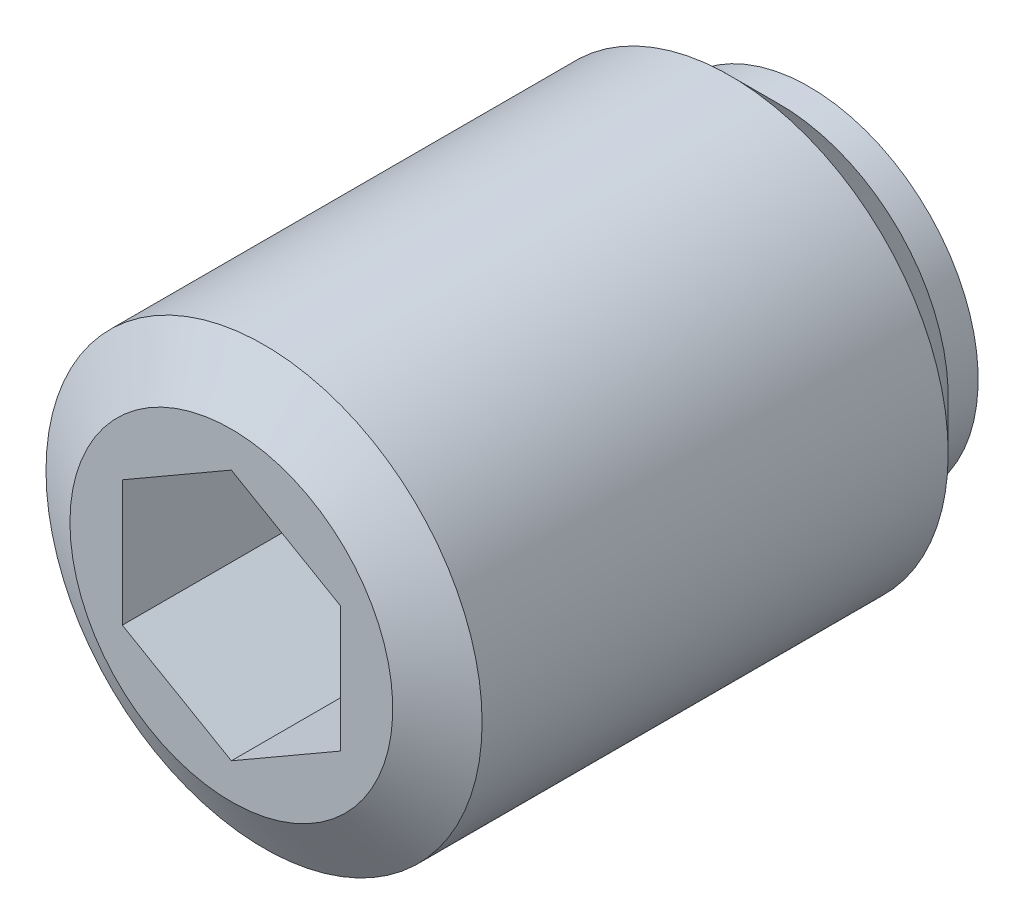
ISO-10303-21;
HEADER;
FILE_DESCRIPTION(('STEP AP214'),'2;1');
FILE_NAME('part.step','',(''),(''),'','','');
FILE_SCHEMA(('AUTOMOTIVE_DESIGN { 1 0 10303 214 1 1 1 1 }'));
ENDSEC;
DATA;
#1=APPLICATION_CONTEXT('core data for automotive mechanical design processes');
#2=APPLICATION_PROTOCOL_DEFINITION('international standard','automotive_design',2000,#1);
#3=PRODUCT_CONTEXT('',#1,'mechanical');
#4=PRODUCT('Part','Part','',(#3));
#5=PRODUCT_RELATED_PRODUCT_CATEGORY('part','',(#4));
#6=PRODUCT_DEFINITION_FORMATION('','',#4);
#7=PRODUCT_DEFINITION_CONTEXT('part definition',#1,'design');
#8=PRODUCT_DEFINITION('design','',#6,#7);
#9=PRODUCT_DEFINITION_SHAPE('','',#8);
#10=(LENGTH_UNIT() NAMED_UNIT(*) SI_UNIT(.MILLI.,.METRE.));
#11=(NAMED_UNIT(*) PLANE_ANGLE_UNIT() SI_UNIT($,.RADIAN.));
#12=(NAMED_UNIT(*) SI_UNIT($,.STERADIAN.) SOLID_ANGLE_UNIT());
#13=UNCERTAINTY_MEASURE_WITH_UNIT(LENGTH_MEASURE(1.E-05),#10,'distance_accuracy_value','');
#14=(GEOMETRIC_REPRESENTATION_CONTEXT(3) GLOBAL_UNCERTAINTY_ASSIGNED_CONTEXT((#13)) GLOBAL_UNIT_ASSIGNED_CONTEXT((#10,
#11,#12)) REPRESENTATION_CONTEXT('',''));
#15=CARTESIAN_POINT('',(0.,0.,0.));
#16=DIRECTION('',(0.,0.,1.));
#17=DIRECTION('',(1.,0.,0.));
#18=AXIS2_PLACEMENT_3D('',#15,#16,#17);
#19=CARTESIAN_POINT('',(0.,0.,2.75));
#20=DIRECTION('',(0.,0.,1.));
#21=DIRECTION('',(0.,-1.,0.));
#22=AXIS2_PLACEMENT_3D('',#19,#20,#21);
#23=SPHERICAL_SURFACE('',#22,2.75);
#24=CARTESIAN_POINT('',(0.,0.,1.4));
#25=DIRECTION('',(0.,0.,1.));
#26=DIRECTION('',(-1.,0.,0.));
#27=AXIS2_PLACEMENT_3D('',#24,#25,#26);
#28=CIRCLE('',#27,2.39582971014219);
#29=CARTESIAN_POINT('',(-2.39582971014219,0.,1.4));
#30=VERTEX_POINT('',#29);
#31=EDGE_CURVE('E9',#30,#30,#28,.T.);
#32=ORIENTED_EDGE('',*,*,#31,.F.);
#33=EDGE_LOOP('',(#32));
#34=FACE_BOUND('',#33,.T.);
#35=ADVANCED_FACE('F14',(#34),#23,.T.);
#36=CARTESIAN_POINT('',(0.,3.1,1.4));
#37=DIRECTION('',(0.,0.,1.));
#38=DIRECTION('',(-1.,0.,0.));
#39=AXIS2_PLACEMENT_3D('',#36,#37,#38);
#40=PLANE('',#39);
#41=CARTESIAN_POINT('',(0.,0.,1.4));
#42=DIRECTION('',(0.,0.,1.));
#43=DIRECTION('',(-1.,0.,0.));
#44=AXIS2_PLACEMENT_3D('',#41,#42,#43);
#45=CIRCLE('',#44,3.1);
#46=CARTESIAN_POINT('',(-3.1,0.,1.4));
#47=VERTEX_POINT('',#46);
#48=EDGE_CURVE('E21',#47,#47,#45,.T.);
#49=ORIENTED_EDGE('',*,*,#48,.F.);
#50=EDGE_LOOP('',(#49));
#51=FACE_BOUND('',#50,.T.);
#52=ORIENTED_EDGE('',*,*,#31,.T.);
#53=EDGE_LOOP('',(#52));
#54=FACE_BOUND('',#53,.T.);
#55=ADVANCED_FACE('F138',(#51,#54),#40,.F.);
#56=CARTESIAN_POINT('',(0.,0.,13.3950749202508));
#57=DIRECTION('',(0.,0.,1.));
#58=DIRECTION('',(-1.,0.,0.));
#59=AXIS2_PLACEMENT_3D('',#56,#57,#58);
#60=CYLINDRICAL_SURFACE('',#59,3.1);
#61=CARTESIAN_POINT('',(0.,0.,1.95));
#62=DIRECTION('',(0.,0.,1.));
#63=DIRECTION('',(-1.,0.,0.));
#64=AXIS2_PLACEMENT_3D('',#61,#62,#63);
#65=CIRCLE('',#64,3.1);
#66=CARTESIAN_POINT('',(-3.1,0.,1.95));
#67=VERTEX_POINT('',#66);
#68=EDGE_CURVE('E131',#67,#67,#65,.T.);
#69=ORIENTED_EDGE('',*,*,#68,.F.);
#70=EDGE_LOOP('',(#69));
#71=FACE_BOUND('',#70,.T.);
#72=ORIENTED_EDGE('',*,*,#48,.T.);
#73=EDGE_LOOP('',(#72));
#74=FACE_BOUND('',#73,.T.);
#75=ADVANCED_FACE('F136',(#71,#74),#60,.T.);
#76=CARTESIAN_POINT('',(0.,0.,1.95));
#77=DIRECTION('',(0.,0.,1.));
#78=DIRECTION('',(-1.,0.,0.));
#79=AXIS2_PLACEMENT_3D('',#76,#77,#78);
#80=CONICAL_SURFACE('',#79,3.1,0.78539816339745);
#81=CARTESIAN_POINT('',(0.,0.,2.85));
#82=DIRECTION('',(0.,0.,1.));
#83=DIRECTION('',(-1.,0.,0.));
#84=AXIS2_PLACEMENT_3D('',#81,#82,#83);
#85=CIRCLE('',#84,4.);
#86=CARTESIAN_POINT('',(-4.,0.,2.85));
#87=VERTEX_POINT('',#86);
#88=EDGE_CURVE('E128',#87,#87,#85,.T.);
#89=ORIENTED_EDGE('',*,*,#88,.F.);
#90=EDGE_LOOP('',(#89));
#91=FACE_BOUND('',#90,.T.);
#92=ORIENTED_EDGE('',*,*,#68,.T.);
#93=EDGE_LOOP('',(#92));
#94=FACE_BOUND('',#93,.T.);
#95=ADVANCED_FACE('F161',(#91,#94),#80,.T.);
#96=CARTESIAN_POINT('',(0.,0.,13.3950749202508));
#97=DIRECTION('',(0.,0.,1.));
#98=DIRECTION('',(-1.,0.,0.));
#99=AXIS2_PLACEMENT_3D('',#96,#97,#98);
#100=CYLINDRICAL_SURFACE('',#99,4.);
#101=CARTESIAN_POINT('',(0.,0.,11.4));
#102=DIRECTION('',(0.,0.,1.));
#103=DIRECTION('',(-1.,0.,0.));
#104=AXIS2_PLACEMENT_3D('',#101,#102,#103);
#105=CIRCLE('',#104,4.);
#106=CARTESIAN_POINT('',(-4.,0.,11.4));
#107=VERTEX_POINT('',#106);
#108=EDGE_CURVE('E125',#107,#107,#105,.T.);
#109=ORIENTED_EDGE('',*,*,#108,.F.);
#110=EDGE_LOOP('',(#109));
#111=FACE_BOUND('',#110,.T.);
#112=ORIENTED_EDGE('',*,*,#88,.T.);
#113=EDGE_LOOP('',(#112));
#114=FACE_BOUND('',#113,.T.);
#115=ADVANCED_FACE('F170',(#111,#114),#100,.T.);
#116=CARTESIAN_POINT('',(0.,0.,11.4));
#117=DIRECTION('',(0.,0.,-1.));
#118=DIRECTION('',(1.,0.,0.));
#119=AXIS2_PLACEMENT_3D('',#116,#117,#118);
#120=CONICAL_SURFACE('',#119,4.,1.04719755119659);
#121=CARTESIAN_POINT('',(0.,0.,12.));
#122=DIRECTION('',(0.,0.,1.));
#123=DIRECTION('',(-1.,0.,0.));
#124=AXIS2_PLACEMENT_3D('',#121,#122,#123);
#125=CIRCLE('',#124,2.96076951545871);
#126=CARTESIAN_POINT('',(-2.9607695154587,0.,12.));
#127=VERTEX_POINT('',#126);
#128=EDGE_CURVE('E116',#127,#127,#125,.T.);
#129=ORIENTED_EDGE('',*,*,#128,.F.);
#130=EDGE_LOOP('',(#129));
#131=FACE_BOUND('',#130,.T.);
#132=ORIENTED_EDGE('',*,*,#108,.T.);
#133=EDGE_LOOP('',(#132));
#134=FACE_BOUND('',#133,.T.);
#135=ADVANCED_FACE('F179',(#131,#134),#120,.T.);
#136=CARTESIAN_POINT('',(0.,0.,12.));
#137=DIRECTION('',(0.,0.,-1.));
#138=DIRECTION('',(1.,0.,0.));
#139=AXIS2_PLACEMENT_3D('',#136,#137,#138);
#140=PLANE('',#139);
#141=DIRECTION('',(-0.866025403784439,-0.5,0.));
#142=VECTOR('',#141,1.);
#143=CARTESIAN_POINT('',(0.,2.30940107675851,12.));
#144=LINE('',#143,#142);
#145=CARTESIAN_POINT('',(0.,2.30940107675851,12.));
#146=VERTEX_POINT('',#145);
#147=CARTESIAN_POINT('',(-2.,1.15470053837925,12.));
#148=VERTEX_POINT('',#147);
#149=EDGE_CURVE('E82',#146,#148,#144,.T.);
#150=ORIENTED_EDGE('',*,*,#149,.F.);
#151=DIRECTION('',(-0.866025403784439,0.5,0.));
#152=VECTOR('',#151,1.);
#153=CARTESIAN_POINT('',(2.,1.15470053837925,12.));
#154=LINE('',#153,#152);
#155=CARTESIAN_POINT('',(2.,1.15470053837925,12.));
#156=VERTEX_POINT('',#155);
#157=EDGE_CURVE('E28',#156,#146,#154,.T.);
#158=ORIENTED_EDGE('',*,*,#157,.F.);
#159=DIRECTION('',(0.,1.,0.));
#160=VECTOR('',#159,1.);
#161=CARTESIAN_POINT('',(2.,-1.15470053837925,12.));
#162=LINE('',#161,#160);
#163=CARTESIAN_POINT('',(2.,-1.15470053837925,12.));
#164=VERTEX_POINT('',#163);
#165=EDGE_CURVE('E98',#164,#156,#162,.T.);
#166=ORIENTED_EDGE('',*,*,#165,.F.);
#167=DIRECTION('',(0.866025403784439,0.5,0.));
#168=VECTOR('',#167,1.);
#169=CARTESIAN_POINT('',(0.,-2.30940107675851,12.));
#170=LINE('',#169,#168);
#171=CARTESIAN_POINT('',(0.,-2.30940107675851,12.));
#172=VERTEX_POINT('',#171);
#173=EDGE_CURVE('E92',#172,#164,#170,.T.);
#174=ORIENTED_EDGE('',*,*,#173,.F.);
#175=DIRECTION('',(0.866025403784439,-0.5,0.));
#176=VECTOR('',#175,1.);
#177=CARTESIAN_POINT('',(-2.,-1.15470053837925,12.));
#178=LINE('',#177,#176);
#179=CARTESIAN_POINT('',(-2.,-1.15470053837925,12.));
#180=VERTEX_POINT('',#179);
#181=EDGE_CURVE('E90',#180,#172,#178,.T.);
#182=ORIENTED_EDGE('',*,*,#181,.F.);
#183=DIRECTION('',(0.,-1.,0.));
#184=VECTOR('',#183,1.);
#185=CARTESIAN_POINT('',(-2.,1.15470053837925,12.));
#186=LINE('',#185,#184);
#187=EDGE_CURVE('E71',#148,#180,#186,.T.);
#188=ORIENTED_EDGE('',*,*,#187,.F.);
#189=EDGE_LOOP('',(#150,#158,#166,#174,#182,#188));
#190=FACE_BOUND('',#189,.T.);
#191=ORIENTED_EDGE('',*,*,#128,.T.);
#192=EDGE_LOOP('',(#191));
#193=FACE_BOUND('',#192,.T.);
#194=ADVANCED_FACE('F86',(#190,#193),#140,.F.);
#195=CARTESIAN_POINT('',(2.,1.15470053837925,8.));
#196=DIRECTION('',(0.5,0.866025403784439,0.));
#197=DIRECTION('',(0.866025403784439,-0.5,0.));
#198=AXIS2_PLACEMENT_3D('',#195,#196,#197);
#199=PLANE('',#198);
#200=ORIENTED_EDGE('',*,*,#157,.T.);
#201=DIRECTION('',(0.,0.,1.));
#202=VECTOR('',#201,1.);
#203=CARTESIAN_POINT('',(0.,2.30940107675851,8.));
#204=LINE('',#203,#202);
#205=CARTESIAN_POINT('',(0.,2.30940107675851,8.));
#206=VERTEX_POINT('',#205);
#207=EDGE_CURVE('E79',#206,#146,#204,.T.);
#208=ORIENTED_EDGE('',*,*,#207,.F.);
#209=DIRECTION('',(-0.866025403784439,0.5,0.));
#210=VECTOR('',#209,1.);
#211=CARTESIAN_POINT('',(2.,1.15470053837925,8.));
#212=LINE('',#211,#210);
#213=CARTESIAN_POINT('',(2.,1.15470053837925,8.));
#214=VERTEX_POINT('',#213);
#215=EDGE_CURVE('E100',#214,#206,#212,.T.);
#216=ORIENTED_EDGE('',*,*,#215,.F.);
#217=DIRECTION('',(0.,0.,1.));
#218=VECTOR('',#217,1.);
#219=CARTESIAN_POINT('',(2.,1.15470053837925,8.));
#220=LINE('',#219,#218);
#221=EDGE_CURVE('E35',#214,#156,#220,.T.);
#222=ORIENTED_EDGE('',*,*,#221,.T.);
#223=EDGE_LOOP('',(#200,#208,#216,#222));
#224=FACE_BOUND('',#223,.T.);
#225=ADVANCED_FACE('F196',(#224),#199,.F.);
#226=CARTESIAN_POINT('',(2.,-1.15470053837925,8.));
#227=DIRECTION('',(1.,0.,0.));
#228=DIRECTION('',(0.,0.,1.));
#229=AXIS2_PLACEMENT_3D('',#226,#227,#228);
#230=PLANE('',#229);
#231=ORIENTED_EDGE('',*,*,#165,.T.);
#232=ORIENTED_EDGE('',*,*,#221,.F.);
#233=DIRECTION('',(0.,1.,0.));
#234=VECTOR('',#233,1.);
#235=CARTESIAN_POINT('',(2.,-1.15470053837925,8.));
#236=LINE('',#235,#234);
#237=CARTESIAN_POINT('',(2.,-1.15470053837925,8.));
#238=VERTEX_POINT('',#237);
#239=EDGE_CURVE('E112',#238,#214,#236,.T.);
#240=ORIENTED_EDGE('',*,*,#239,.F.);
#241=DIRECTION('',(0.,0.,1.));
#242=VECTOR('',#241,1.);
#243=CARTESIAN_POINT('',(2.,-1.15470053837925,8.));
#244=LINE('',#243,#242);
#245=EDGE_CURVE('E117',#238,#164,#244,.T.);
#246=ORIENTED_EDGE('',*,*,#245,.T.);
#247=EDGE_LOOP('',(#231,#232,#240,#246));
#248=FACE_BOUND('',#247,.T.);
#249=ADVANCED_FACE('F204',(#248),#230,.F.);
#250=CARTESIAN_POINT('',(0.,-2.30940107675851,8.));
#251=DIRECTION('',(0.5,-0.866025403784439,0.));
#252=DIRECTION('',(-0.866025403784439,-0.5,0.));
#253=AXIS2_PLACEMENT_3D('',#250,#251,#252);
#254=PLANE('',#253);
#255=ORIENTED_EDGE('',*,*,#173,.T.);
#256=ORIENTED_EDGE('',*,*,#245,.F.);
#257=DIRECTION('',(0.866025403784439,0.5,0.));
#258=VECTOR('',#257,1.);
#259=CARTESIAN_POINT('',(0.,-2.30940107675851,8.));
#260=LINE('',#259,#258);
#261=CARTESIAN_POINT('',(0.,-2.30940107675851,8.));
#262=VERTEX_POINT('',#261);
#263=EDGE_CURVE('E109',#262,#238,#260,.T.);
#264=ORIENTED_EDGE('',*,*,#263,.F.);
#265=DIRECTION('',(0.,0.,1.));
#266=VECTOR('',#265,1.);
#267=CARTESIAN_POINT('',(0.,-2.30940107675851,8.));
#268=LINE('',#267,#266);
#269=EDGE_CURVE('E119',#262,#172,#268,.T.);
#270=ORIENTED_EDGE('',*,*,#269,.T.);
#271=EDGE_LOOP('',(#255,#256,#264,#270));
#272=FACE_BOUND('',#271,.T.);
#273=ADVANCED_FACE('F212',(#272),#254,.F.);
#274=CARTESIAN_POINT('',(-2.,-1.15470053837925,8.));
#275=DIRECTION('',(-0.5,-0.866025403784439,0.));
#276=DIRECTION('',(-0.866025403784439,0.5,0.));
#277=AXIS2_PLACEMENT_3D('',#274,#275,#276);
#278=PLANE('',#277);
#279=ORIENTED_EDGE('',*,*,#181,.T.);
#280=ORIENTED_EDGE('',*,*,#269,.F.);
#281=DIRECTION('',(0.866025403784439,-0.5,0.));
#282=VECTOR('',#281,1.);
#283=CARTESIAN_POINT('',(-2.,-1.15470053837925,8.));
#284=LINE('',#283,#282);
#285=CARTESIAN_POINT('',(-2.,-1.15470053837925,8.));
#286=VERTEX_POINT('',#285);
#287=EDGE_CURVE('E106',#286,#262,#284,.T.);
#288=ORIENTED_EDGE('',*,*,#287,.F.);
#289=DIRECTION('',(0.,0.,1.));
#290=VECTOR('',#289,1.);
#291=CARTESIAN_POINT('',(-2.,-1.15470053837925,8.));
#292=LINE('',#291,#290);
#293=EDGE_CURVE('E78',#286,#180,#292,.T.);
#294=ORIENTED_EDGE('',*,*,#293,.T.);
#295=EDGE_LOOP('',(#279,#280,#288,#294));
#296=FACE_BOUND('',#295,.T.);
#297=ADVANCED_FACE('F220',(#296),#278,.F.);
#298=CARTESIAN_POINT('',(-2.,1.15470053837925,8.));
#299=DIRECTION('',(-1.,0.,0.));
#300=DIRECTION('',(0.,1.,0.));
#301=AXIS2_PLACEMENT_3D('',#298,#299,#300);
#302=PLANE('',#301);
#303=ORIENTED_EDGE('',*,*,#187,.T.);
#304=ORIENTED_EDGE('',*,*,#293,.F.);
#305=DIRECTION('',(0.,-1.,0.));
#306=VECTOR('',#305,1.);
#307=CARTESIAN_POINT('',(-2.,1.15470053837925,8.));
#308=LINE('',#307,#306);
#309=CARTESIAN_POINT('',(-2.,1.15470053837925,8.));
#310=VERTEX_POINT('',#309);
#311=EDGE_CURVE('E74',#310,#286,#308,.T.);
#312=ORIENTED_EDGE('',*,*,#311,.F.);
#313=DIRECTION('',(0.,0.,1.));
#314=VECTOR('',#313,1.);
#315=CARTESIAN_POINT('',(-2.,1.15470053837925,8.));
#316=LINE('',#315,#314);
#317=EDGE_CURVE('E67',#310,#148,#316,.T.);
#318=ORIENTED_EDGE('',*,*,#317,.T.);
#319=EDGE_LOOP('',(#303,#304,#312,#318));
#320=FACE_BOUND('',#319,.T.);
#321=ADVANCED_FACE('F69',(#320),#302,.F.);
#322=CARTESIAN_POINT('',(0.,2.30940107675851,8.));
#323=DIRECTION('',(-0.5,0.866025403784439,0.));
#324=DIRECTION('',(0.866025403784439,0.5,0.));
#325=AXIS2_PLACEMENT_3D('',#322,#323,#324);
#326=PLANE('',#325);
#327=ORIENTED_EDGE('',*,*,#149,.T.);
#328=ORIENTED_EDGE('',*,*,#317,.F.);
#329=DIRECTION('',(-0.866025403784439,-0.5,0.));
#330=VECTOR('',#329,1.);
#331=CARTESIAN_POINT('',(0.,2.30940107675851,8.));
#332=LINE('',#331,#330);
#333=EDGE_CURVE('E103',#206,#310,#332,.T.);
#334=ORIENTED_EDGE('',*,*,#333,.F.);
#335=ORIENTED_EDGE('',*,*,#207,.T.);
#336=EDGE_LOOP('',(#327,#328,#334,#335));
#337=FACE_BOUND('',#336,.T.);
#338=ADVANCED_FACE('F83',(#337),#326,.F.);
#339=CARTESIAN_POINT('',(2.,1.15470053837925,8.));
#340=DIRECTION('',(0.,0.,-1.));
#341=DIRECTION('',(1.,0.,0.));
#342=AXIS2_PLACEMENT_3D('',#339,#340,#341);
#343=PLANE('',#342);
#344=ORIENTED_EDGE('',*,*,#215,.T.);
#345=ORIENTED_EDGE('',*,*,#333,.T.);
#346=ORIENTED_EDGE('',*,*,#311,.T.);
#347=ORIENTED_EDGE('',*,*,#287,.T.);
#348=ORIENTED_EDGE('',*,*,#263,.T.);
#349=ORIENTED_EDGE('',*,*,#239,.T.);
#350=EDGE_LOOP('',(#344,#345,#346,#347,#348,#349));
#351=FACE_BOUND('',#350,.T.);
#352=ADVANCED_FACE('F244',(#351),#343,.F.);
#353=CLOSED_SHELL('',(#35,#55,#75,#95,#115,#135,#194,#225,#249,#273,#297,#321,#338,#352));
#354=MANIFOLD_SOLID_BREP('B1',#353);
#355=ADVANCED_BREP_SHAPE_REPRESENTATION('',(#18,#354),#14);
#356=SHAPE_DEFINITION_REPRESENTATION(#9,#355);
ENDSEC;
END-ISO-10303-21;
